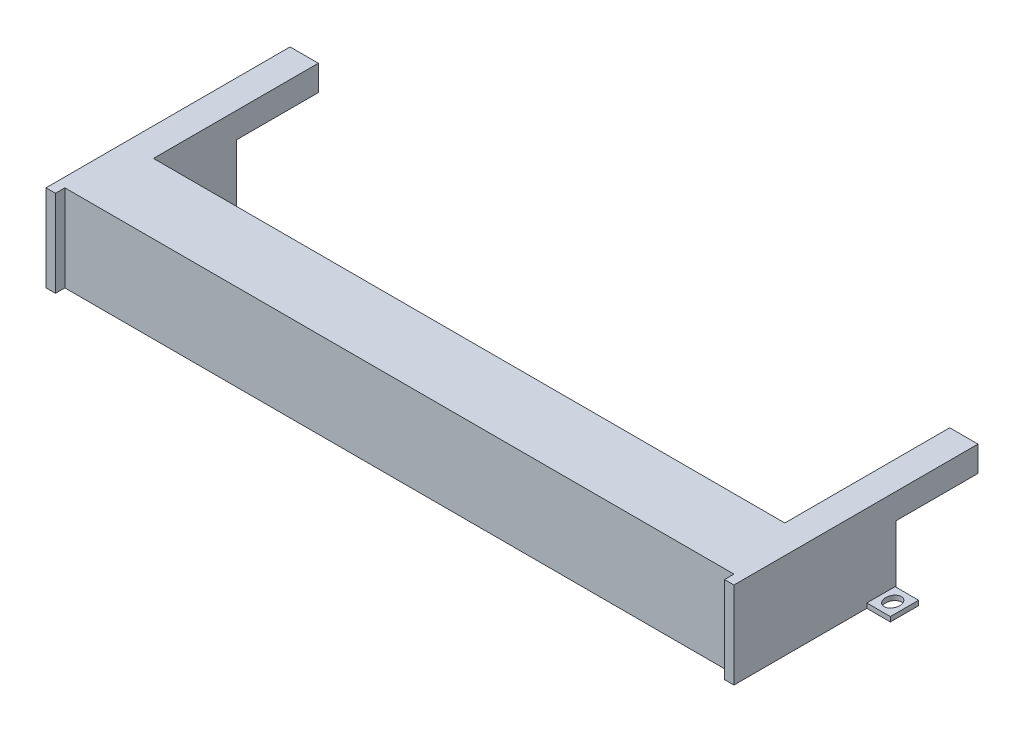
ISO-10303-21;
HEADER;
FILE_DESCRIPTION(('STEP AP214'),'2;1');
FILE_NAME('part.step','',(''),(''),'','','');
FILE_SCHEMA(('AUTOMOTIVE_DESIGN { 1 0 10303 214 1 1 1 1 }'));
ENDSEC;
DATA;
#1=APPLICATION_CONTEXT('core data for automotive mechanical design processes');
#2=APPLICATION_PROTOCOL_DEFINITION('international standard','automotive_design',2000,#1);
#3=PRODUCT_CONTEXT('',#1,'mechanical');
#4=PRODUCT('Part','Part','',(#3));
#5=PRODUCT_RELATED_PRODUCT_CATEGORY('part','',(#4));
#6=PRODUCT_DEFINITION_FORMATION('','',#4);
#7=PRODUCT_DEFINITION_CONTEXT('part definition',#1,'design');
#8=PRODUCT_DEFINITION('design','',#6,#7);
#9=PRODUCT_DEFINITION_SHAPE('','',#8);
#10=(LENGTH_UNIT() NAMED_UNIT(*) SI_UNIT(.MILLI.,.METRE.));
#11=(NAMED_UNIT(*) PLANE_ANGLE_UNIT() SI_UNIT($,.RADIAN.));
#12=(NAMED_UNIT(*) SI_UNIT($,.STERADIAN.) SOLID_ANGLE_UNIT());
#13=UNCERTAINTY_MEASURE_WITH_UNIT(LENGTH_MEASURE(1.E-05),#10,'distance_accuracy_value','');
#14=(GEOMETRIC_REPRESENTATION_CONTEXT(3) GLOBAL_UNCERTAINTY_ASSIGNED_CONTEXT((#13)) GLOBAL_UNIT_ASSIGNED_CONTEXT((#10,
#11,#12)) REPRESENTATION_CONTEXT('',''));
#15=CARTESIAN_POINT('',(0.,0.,0.));
#16=DIRECTION('',(0.,0.,1.));
#17=DIRECTION('',(1.,0.,0.));
#18=AXIS2_PLACEMENT_3D('',#15,#16,#17);
#19=CARTESIAN_POINT('',(-36.5,9.2,-12.95));
#20=DIRECTION('',(1.,0.,0.));
#21=DIRECTION('',(0.,0.,-1.));
#22=AXIS2_PLACEMENT_3D('',#19,#20,#21);
#23=PLANE('',#22);
#24=DIRECTION('',(0.,-1.,0.));
#25=VECTOR('',#24,1.);
#26=CARTESIAN_POINT('',(-36.5,0.5,-4.14999999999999));
#27=LINE('',#26,#25);
#28=CARTESIAN_POINT('',(-36.5,0.5,-4.14999999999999));
#29=VERTEX_POINT('',#28);
#30=CARTESIAN_POINT('',(-36.5,0.,-4.14999999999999));
#31=VERTEX_POINT('',#30);
#32=EDGE_CURVE('E215',#29,#31,#27,.T.);
#33=ORIENTED_EDGE('',*,*,#32,.F.);
#34=DIRECTION('',(0.,0.,-1.));
#35=VECTOR('',#34,1.);
#36=CARTESIAN_POINT('',(-36.5,0.5,-1.14999999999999));
#37=LINE('',#36,#35);
#38=CARTESIAN_POINT('',(-36.5,0.5,-1.14999999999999));
#39=VERTEX_POINT('',#38);
#40=EDGE_CURVE('E200',#39,#29,#37,.T.);
#41=ORIENTED_EDGE('',*,*,#40,.F.);
#42=DIRECTION('',(0.,-1.,0.));
#43=VECTOR('',#42,1.);
#44=CARTESIAN_POINT('',(-36.5,0.5,-1.14999999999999));
#45=LINE('',#44,#43);
#46=CARTESIAN_POINT('',(-36.5,0.,-1.15));
#47=VERTEX_POINT('',#46);
#48=EDGE_CURVE('E206',#39,#47,#45,.T.);
#49=ORIENTED_EDGE('',*,*,#48,.T.);
#50=DIRECTION('',(0.,0.,1.));
#51=VECTOR('',#50,1.);
#52=CARTESIAN_POINT('',(-36.5,0.,-12.95));
#53=LINE('',#52,#51);
#54=CARTESIAN_POINT('',(-36.5,0.,12.95));
#55=VERTEX_POINT('',#54);
#56=EDGE_CURVE('E237',#47,#55,#53,.T.);
#57=ORIENTED_EDGE('',*,*,#56,.T.);
#58=DIRECTION('',(0.,-1.,0.));
#59=VECTOR('',#58,1.);
#60=CARTESIAN_POINT('',(-36.5,9.2,12.95));
#61=LINE('',#60,#59);
#62=CARTESIAN_POINT('',(-36.5,9.2,12.95));
#63=VERTEX_POINT('',#62);
#64=EDGE_CURVE('E404',#63,#55,#61,.T.);
#65=ORIENTED_EDGE('',*,*,#64,.F.);
#66=DIRECTION('',(0.,0.,1.));
#67=VECTOR('',#66,1.);
#68=CARTESIAN_POINT('',(-36.5,9.2,-12.95));
#69=LINE('',#68,#67);
#70=CARTESIAN_POINT('',(-36.5,9.2,-12.95));
#71=VERTEX_POINT('',#70);
#72=EDGE_CURVE('E376',#71,#63,#69,.T.);
#73=ORIENTED_EDGE('',*,*,#72,.F.);
#74=DIRECTION('',(0.,-1.,0.));
#75=VECTOR('',#74,1.);
#76=CARTESIAN_POINT('',(-36.5,9.2,-12.95));
#77=LINE('',#76,#75);
#78=CARTESIAN_POINT('',(-36.5,6.5,-12.95));
#79=VERTEX_POINT('',#78);
#80=EDGE_CURVE('E370',#71,#79,#77,.T.);
#81=ORIENTED_EDGE('',*,*,#80,.T.);
#82=DIRECTION('',(0.,0.,-1.));
#83=VECTOR('',#82,1.);
#84=CARTESIAN_POINT('',(-36.5,6.5,-12.95));
#85=LINE('',#84,#83);
#86=CARTESIAN_POINT('',(-36.5,6.5,-4.25));
#87=VERTEX_POINT('',#86);
#88=EDGE_CURVE('E481',#87,#79,#85,.T.);
#89=ORIENTED_EDGE('',*,*,#88,.F.);
#90=DIRECTION('',(0.,1.,0.));
#91=VECTOR('',#90,1.);
#92=CARTESIAN_POINT('',(-36.5,0.,-4.25));
#93=LINE('',#92,#91);
#94=CARTESIAN_POINT('',(-36.5,0.,-4.25));
#95=VERTEX_POINT('',#94);
#96=EDGE_CURVE('E468',#95,#87,#93,.T.);
#97=ORIENTED_EDGE('',*,*,#96,.F.);
#98=EDGE_CURVE('E412',#95,#31,#53,.T.);
#99=ORIENTED_EDGE('',*,*,#98,.T.);
#100=EDGE_LOOP('',(#33,#41,#49,#57,#65,#73,#81,#89,#97,#99));
#101=FACE_BOUND('',#100,.T.);
#102=ADVANCED_FACE('F31',(#101),#23,.F.);
#103=CARTESIAN_POINT('',(-36.5,9.2,-12.95));
#104=DIRECTION('',(0.,0.,1.));
#105=DIRECTION('',(1.,0.,0.));
#106=AXIS2_PLACEMENT_3D('',#103,#104,#105);
#107=PLANE('',#106);
#108=DIRECTION('',(-1.,0.,0.));
#109=VECTOR('',#108,1.);
#110=CARTESIAN_POINT('',(-36.5,9.2,-12.95));
#111=LINE('',#110,#109);
#112=CARTESIAN_POINT('',(-33.5,9.2,-12.95));
#113=VERTEX_POINT('',#112);
#114=EDGE_CURVE('E366',#113,#71,#111,.T.);
#115=ORIENTED_EDGE('',*,*,#114,.F.);
#116=DIRECTION('',(0.,1.,0.));
#117=VECTOR('',#116,1.);
#118=CARTESIAN_POINT('',(-33.5,-4.99999999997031E-05,-12.95));
#119=LINE('',#118,#117);
#120=CARTESIAN_POINT('',(-33.5,6.5,-12.95));
#121=VERTEX_POINT('',#120);
#122=EDGE_CURVE('E260',#121,#113,#119,.T.);
#123=ORIENTED_EDGE('',*,*,#122,.F.);
#124=DIRECTION('',(1.,0.,0.));
#125=VECTOR('',#124,1.);
#126=CARTESIAN_POINT('',(-36.501,6.5,-12.95));
#127=LINE('',#126,#125);
#128=EDGE_CURVE('E487',#79,#121,#127,.T.);
#129=ORIENTED_EDGE('',*,*,#128,.F.);
#130=ORIENTED_EDGE('',*,*,#80,.F.);
#131=EDGE_LOOP('',(#115,#123,#129,#130));
#132=FACE_BOUND('',#131,.T.);
#133=ADVANCED_FACE('F347',(#132),#107,.F.);
#134=CARTESIAN_POINT('',(-36.501,0.,-4.25));
#135=DIRECTION('',(0.,0.,1.));
#136=DIRECTION('',(1.,0.,0.));
#137=AXIS2_PLACEMENT_3D('',#134,#135,#136);
#138=PLANE('',#137);
#139=DIRECTION('',(1.,0.,0.));
#140=VECTOR('',#139,1.);
#141=CARTESIAN_POINT('',(-36.501,6.5,-4.25));
#142=LINE('',#141,#140);
#143=CARTESIAN_POINT('',(-33.5,6.5,-4.25));
#144=VERTEX_POINT('',#143);
#145=EDGE_CURVE('E483',#87,#144,#142,.T.);
#146=ORIENTED_EDGE('',*,*,#145,.T.);
#147=DIRECTION('',(0.,-1.,0.));
#148=VECTOR('',#147,1.);
#149=CARTESIAN_POINT('',(-33.5,0.,-4.25));
#150=LINE('',#149,#148);
#151=CARTESIAN_POINT('',(-33.5,0.,-4.25));
#152=VERTEX_POINT('',#151);
#153=EDGE_CURVE('E272',#144,#152,#150,.T.);
#154=ORIENTED_EDGE('',*,*,#153,.T.);
#155=DIRECTION('',(1.,0.,0.));
#156=VECTOR('',#155,1.);
#157=CARTESIAN_POINT('',(-36.501,0.,-4.25));
#158=LINE('',#157,#156);
#159=EDGE_CURVE('E478',#95,#152,#158,.T.);
#160=ORIENTED_EDGE('',*,*,#159,.F.);
#161=ORIENTED_EDGE('',*,*,#96,.T.);
#162=EDGE_LOOP('',(#146,#154,#160,#161));
#163=FACE_BOUND('',#162,.T.);
#164=ADVANCED_FACE('F328',(#163),#138,.F.);
#165=CARTESIAN_POINT('',(-36.501,6.5,-12.95));
#166=DIRECTION('',(0.,1.,0.));
#167=DIRECTION('',(0.,0.,1.));
#168=AXIS2_PLACEMENT_3D('',#165,#166,#167);
#169=PLANE('',#168);
#170=ORIENTED_EDGE('',*,*,#128,.T.);
#171=DIRECTION('',(0.,0.,1.));
#172=VECTOR('',#171,1.);
#173=CARTESIAN_POINT('',(-33.5,6.5,-12.95));
#174=LINE('',#173,#172);
#175=EDGE_CURVE('E40',#121,#144,#174,.T.);
#176=ORIENTED_EDGE('',*,*,#175,.T.);
#177=ORIENTED_EDGE('',*,*,#145,.F.);
#178=ORIENTED_EDGE('',*,*,#88,.T.);
#179=EDGE_LOOP('',(#170,#176,#177,#178));
#180=FACE_BOUND('',#179,.T.);
#181=ADVANCED_FACE('F332',(#180),#169,.F.);
#182=CARTESIAN_POINT('',(36.5,9.2,-12.95));
#183=DIRECTION('',(-1.,0.,0.));
#184=DIRECTION('',(0.,0.,1.));
#185=AXIS2_PLACEMENT_3D('',#182,#183,#184);
#186=PLANE('',#185);
#187=DIRECTION('',(0.,-1.,0.));
#188=VECTOR('',#187,1.);
#189=CARTESIAN_POINT('',(36.5,0.5,-1.14999999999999));
#190=LINE('',#189,#188);
#191=CARTESIAN_POINT('',(36.5,0.5,-1.14999999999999));
#192=VERTEX_POINT('',#191);
#193=CARTESIAN_POINT('',(36.5,0.,-1.14999999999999));
#194=VERTEX_POINT('',#193);
#195=EDGE_CURVE('E431',#192,#194,#190,.T.);
#196=ORIENTED_EDGE('',*,*,#195,.F.);
#197=DIRECTION('',(0.,0.,-1.));
#198=VECTOR('',#197,1.);
#199=CARTESIAN_POINT('',(36.5,0.5,-1.14999999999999));
#200=LINE('',#199,#198);
#201=CARTESIAN_POINT('',(36.5,0.5,-4.14999999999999));
#202=VERTEX_POINT('',#201);
#203=EDGE_CURVE('E427',#192,#202,#200,.T.);
#204=ORIENTED_EDGE('',*,*,#203,.T.);
#205=DIRECTION('',(0.,-1.,0.));
#206=VECTOR('',#205,1.);
#207=CARTESIAN_POINT('',(36.5,0.5,-4.14999999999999));
#208=LINE('',#207,#206);
#209=CARTESIAN_POINT('',(36.5,0.,-4.15));
#210=VERTEX_POINT('',#209);
#211=EDGE_CURVE('E435',#202,#210,#208,.T.);
#212=ORIENTED_EDGE('',*,*,#211,.T.);
#213=DIRECTION('',(0.,0.,-1.));
#214=VECTOR('',#213,1.);
#215=CARTESIAN_POINT('',(36.5,0.,-12.95));
#216=LINE('',#215,#214);
#217=CARTESIAN_POINT('',(36.5,0.,-4.25));
#218=VERTEX_POINT('',#217);
#219=EDGE_CURVE('E393',#210,#218,#216,.T.);
#220=ORIENTED_EDGE('',*,*,#219,.T.);
#221=DIRECTION('',(0.,-1.,0.));
#222=VECTOR('',#221,1.);
#223=CARTESIAN_POINT('',(36.5,0.,-4.25));
#224=LINE('',#223,#222);
#225=CARTESIAN_POINT('',(36.5,6.5,-4.25));
#226=VERTEX_POINT('',#225);
#227=EDGE_CURVE('E474',#226,#218,#224,.T.);
#228=ORIENTED_EDGE('',*,*,#227,.F.);
#229=DIRECTION('',(0.,0.,1.));
#230=VECTOR('',#229,1.);
#231=CARTESIAN_POINT('',(36.5,6.5,-12.95));
#232=LINE('',#231,#230);
#233=CARTESIAN_POINT('',(36.5,6.5,-12.95));
#234=VERTEX_POINT('',#233);
#235=EDGE_CURVE('E471',#234,#226,#232,.T.);
#236=ORIENTED_EDGE('',*,*,#235,.F.);
#237=DIRECTION('',(0.,-1.,0.));
#238=VECTOR('',#237,1.);
#239=CARTESIAN_POINT('',(36.5,9.2,-12.95));
#240=LINE('',#239,#238);
#241=CARTESIAN_POINT('',(36.5,9.2,-12.95));
#242=VERTEX_POINT('',#241);
#243=EDGE_CURVE('E399',#242,#234,#240,.T.);
#244=ORIENTED_EDGE('',*,*,#243,.F.);
#245=DIRECTION('',(0.,0.,-1.));
#246=VECTOR('',#245,1.);
#247=CARTESIAN_POINT('',(36.5,9.2,-12.95));
#248=LINE('',#247,#246);
#249=CARTESIAN_POINT('',(36.5,9.2,12.95));
#250=VERTEX_POINT('',#249);
#251=EDGE_CURVE('E373',#250,#242,#248,.T.);
#252=ORIENTED_EDGE('',*,*,#251,.F.);
#253=DIRECTION('',(0.,-1.,0.));
#254=VECTOR('',#253,1.);
#255=CARTESIAN_POINT('',(36.5,9.2,12.95));
#256=LINE('',#255,#254);
#257=CARTESIAN_POINT('',(36.5,0.,12.95));
#258=VERTEX_POINT('',#257);
#259=EDGE_CURVE('E387',#250,#258,#256,.T.);
#260=ORIENTED_EDGE('',*,*,#259,.T.);
#261=EDGE_CURVE('E396',#258,#194,#216,.T.);
#262=ORIENTED_EDGE('',*,*,#261,.T.);
#263=EDGE_LOOP('',(#196,#204,#212,#220,#228,#236,#244,#252,#260,#262));
#264=FACE_BOUND('',#263,.T.);
#265=ADVANCED_FACE('F33',(#264),#186,.F.);
#266=CARTESIAN_POINT('',(-36.5,9.2,12.95));
#267=DIRECTION('',(0.,0.,-1.));
#268=DIRECTION('',(-1.,0.,0.));
#269=AXIS2_PLACEMENT_3D('',#266,#267,#268);
#270=PLANE('',#269);
#271=DIRECTION('',(1.,0.,0.));
#272=VECTOR('',#271,1.);
#273=CARTESIAN_POINT('',(-36.5,0.,12.95));
#274=LINE('',#273,#272);
#275=CARTESIAN_POINT('',(-35.5,0.,12.95));
#276=VERTEX_POINT('',#275);
#277=EDGE_CURVE('E378',#55,#276,#274,.T.);
#278=ORIENTED_EDGE('',*,*,#277,.T.);
#279=DIRECTION('',(0.,-1.,0.));
#280=VECTOR('',#279,1.);
#281=CARTESIAN_POINT('',(-35.5,-0.001000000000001,12.95));
#282=LINE('',#281,#280);
#283=CARTESIAN_POINT('',(-35.5,9.2,12.95));
#284=VERTEX_POINT('',#283);
#285=EDGE_CURVE('E447',#284,#276,#282,.T.);
#286=ORIENTED_EDGE('',*,*,#285,.F.);
#287=DIRECTION('',(1.,0.,0.));
#288=VECTOR('',#287,1.);
#289=CARTESIAN_POINT('',(-36.5,9.2,12.95));
#290=LINE('',#289,#288);
#291=EDGE_CURVE('E384',#63,#284,#290,.T.);
#292=ORIENTED_EDGE('',*,*,#291,.F.);
#293=ORIENTED_EDGE('',*,*,#64,.T.);
#294=EDGE_LOOP('',(#278,#286,#292,#293));
#295=FACE_BOUND('',#294,.T.);
#296=ADVANCED_FACE('F345',(#295),#270,.F.);
#297=CARTESIAN_POINT('',(33.5,6.5,-12.95));
#298=VERTEX_POINT('',#297);
#299=EDGE_CURVE('E477',#298,#234,#127,.T.);
#300=ORIENTED_EDGE('',*,*,#299,.F.);
#301=DIRECTION('',(0.,1.,0.));
#302=VECTOR('',#301,1.);
#303=CARTESIAN_POINT('',(33.5,-4.99999999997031E-05,-12.95));
#304=LINE('',#303,#302);
#305=CARTESIAN_POINT('',(33.5,9.2,-12.95));
#306=VERTEX_POINT('',#305);
#307=EDGE_CURVE('E56',#298,#306,#304,.T.);
#308=ORIENTED_EDGE('',*,*,#307,.T.);
#309=EDGE_CURVE('E372',#242,#306,#111,.T.);
#310=ORIENTED_EDGE('',*,*,#309,.F.);
#311=ORIENTED_EDGE('',*,*,#243,.T.);
#312=EDGE_LOOP('',(#300,#308,#310,#311));
#313=FACE_BOUND('',#312,.T.);
#314=ADVANCED_FACE('F343',(#313),#107,.F.);
#315=CARTESIAN_POINT('',(35.5,9.2,12.95));
#316=VERTEX_POINT('',#315);
#317=EDGE_CURVE('E383',#316,#250,#290,.T.);
#318=ORIENTED_EDGE('',*,*,#317,.F.);
#319=DIRECTION('',(0.,1.,0.));
#320=VECTOR('',#319,1.);
#321=CARTESIAN_POINT('',(35.5,-0.001000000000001,12.95));
#322=LINE('',#321,#320);
#323=CARTESIAN_POINT('',(35.5,0.,12.95));
#324=VERTEX_POINT('',#323);
#325=EDGE_CURVE('E433',#324,#316,#322,.T.);
#326=ORIENTED_EDGE('',*,*,#325,.F.);
#327=EDGE_CURVE('E409',#324,#258,#274,.T.);
#328=ORIENTED_EDGE('',*,*,#327,.T.);
#329=ORIENTED_EDGE('',*,*,#259,.F.);
#330=EDGE_LOOP('',(#318,#326,#328,#329));
#331=FACE_BOUND('',#330,.T.);
#332=ADVANCED_FACE('F336',(#331),#270,.F.);
#333=CARTESIAN_POINT('',(36.5,9.2,12.95));
#334=DIRECTION('',(0.,1.,0.));
#335=DIRECTION('',(0.,0.,1.));
#336=AXIS2_PLACEMENT_3D('',#333,#334,#335);
#337=PLANE('',#336);
#338=DIRECTION('',(0.,0.,1.));
#339=VECTOR('',#338,1.);
#340=CARTESIAN_POINT('',(-33.5,9.2,-12.95));
#341=LINE('',#340,#339);
#342=CARTESIAN_POINT('',(-33.5,9.2,4.55));
#343=VERTEX_POINT('',#342);
#344=EDGE_CURVE('E233',#113,#343,#341,.T.);
#345=ORIENTED_EDGE('',*,*,#344,.F.);
#346=ORIENTED_EDGE('',*,*,#114,.T.);
#347=ORIENTED_EDGE('',*,*,#72,.T.);
#348=ORIENTED_EDGE('',*,*,#291,.T.);
#349=DIRECTION('',(0.,0.,1.));
#350=VECTOR('',#349,1.);
#351=CARTESIAN_POINT('',(-35.5,9.2,16.9167711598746));
#352=LINE('',#351,#350);
#353=CARTESIAN_POINT('',(-35.5,9.2,11.95));
#354=VERTEX_POINT('',#353);
#355=EDGE_CURVE('E454',#354,#284,#352,.T.);
#356=ORIENTED_EDGE('',*,*,#355,.F.);
#357=DIRECTION('',(-1.,0.,0.));
#358=VECTOR('',#357,1.);
#359=CARTESIAN_POINT('',(-35.5,9.2,11.95));
#360=LINE('',#359,#358);
#361=CARTESIAN_POINT('',(35.5,9.2,11.95));
#362=VERTEX_POINT('',#361);
#363=EDGE_CURVE('E459',#362,#354,#360,.T.);
#364=ORIENTED_EDGE('',*,*,#363,.F.);
#365=DIRECTION('',(0.,0.,-1.));
#366=VECTOR('',#365,1.);
#367=CARTESIAN_POINT('',(35.5,9.2,16.9167711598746));
#368=LINE('',#367,#366);
#369=EDGE_CURVE('E456',#316,#362,#368,.T.);
#370=ORIENTED_EDGE('',*,*,#369,.F.);
#371=ORIENTED_EDGE('',*,*,#317,.T.);
#372=ORIENTED_EDGE('',*,*,#251,.T.);
#373=ORIENTED_EDGE('',*,*,#309,.T.);
#374=DIRECTION('',(0.,0.,-1.));
#375=VECTOR('',#374,1.);
#376=CARTESIAN_POINT('',(33.5,9.2,-12.95));
#377=LINE('',#376,#375);
#378=CARTESIAN_POINT('',(33.5,9.2,4.55));
#379=VERTEX_POINT('',#378);
#380=EDGE_CURVE('E253',#379,#306,#377,.T.);
#381=ORIENTED_EDGE('',*,*,#380,.F.);
#382=DIRECTION('',(1.,0.,0.));
#383=VECTOR('',#382,1.);
#384=CARTESIAN_POINT('',(-33.5,9.2,4.55));
#385=LINE('',#384,#383);
#386=EDGE_CURVE('E247',#343,#379,#385,.T.);
#387=ORIENTED_EDGE('',*,*,#386,.F.);
#388=EDGE_LOOP('',(#345,#346,#347,#348,#356,#364,#370,#371,#372,#373,#381,#387));
#389=FACE_BOUND('',#388,.T.);
#390=ADVANCED_FACE('F333',(#389),#337,.T.);
#391=CARTESIAN_POINT('',(36.5,0.,12.95));
#392=DIRECTION('',(0.,1.,0.));
#393=DIRECTION('',(0.,0.,1.));
#394=AXIS2_PLACEMENT_3D('',#391,#392,#393);
#395=PLANE('',#394);
#396=ORIENTED_EDGE('',*,*,#159,.T.);
#397=DIRECTION('',(0.,0.,1.));
#398=VECTOR('',#397,1.);
#399=CARTESIAN_POINT('',(-33.5,0.,12.95));
#400=LINE('',#399,#398);
#401=CARTESIAN_POINT('',(-33.5,0.,4.55));
#402=VERTEX_POINT('',#401);
#403=EDGE_CURVE('E275',#152,#402,#400,.T.);
#404=ORIENTED_EDGE('',*,*,#403,.T.);
#405=DIRECTION('',(1.,0.,0.));
#406=VECTOR('',#405,1.);
#407=CARTESIAN_POINT('',(36.5,0.,4.55));
#408=LINE('',#407,#406);
#409=CARTESIAN_POINT('',(33.5,0.,4.55));
#410=VERTEX_POINT('',#409);
#411=EDGE_CURVE('E11',#402,#410,#408,.T.);
#412=ORIENTED_EDGE('',*,*,#411,.T.);
#413=DIRECTION('',(0.,0.,-1.));
#414=VECTOR('',#413,1.);
#415=CARTESIAN_POINT('',(33.5,0.,12.95));
#416=LINE('',#415,#414);
#417=CARTESIAN_POINT('',(33.5,0.,-4.25));
#418=VERTEX_POINT('',#417);
#419=EDGE_CURVE('E269',#410,#418,#416,.T.);
#420=ORIENTED_EDGE('',*,*,#419,.T.);
#421=EDGE_CURVE('E482',#418,#218,#158,.T.);
#422=ORIENTED_EDGE('',*,*,#421,.T.);
#423=ORIENTED_EDGE('',*,*,#219,.F.);
#424=DIRECTION('',(1.,0.,0.));
#425=VECTOR('',#424,1.);
#426=CARTESIAN_POINT('',(39.,0.,-4.14999999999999));
#427=LINE('',#426,#425);
#428=CARTESIAN_POINT('',(39.,0.,-4.14999999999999));
#429=VERTEX_POINT('',#428);
#430=EDGE_CURVE('E283',#210,#429,#427,.T.);
#431=ORIENTED_EDGE('',*,*,#430,.T.);
#432=DIRECTION('',(0.,0.,1.));
#433=VECTOR('',#432,1.);
#434=CARTESIAN_POINT('',(39.,0.,-1.14999999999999));
#435=LINE('',#434,#433);
#436=CARTESIAN_POINT('',(39.,0.,-1.14999999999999));
#437=VERTEX_POINT('',#436);
#438=EDGE_CURVE('E428',#429,#437,#435,.T.);
#439=ORIENTED_EDGE('',*,*,#438,.T.);
#440=DIRECTION('',(-1.,0.,0.));
#441=VECTOR('',#440,1.);
#442=CARTESIAN_POINT('',(39.,0.,-1.14999999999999));
#443=LINE('',#442,#441);
#444=EDGE_CURVE('E424',#437,#194,#443,.T.);
#445=ORIENTED_EDGE('',*,*,#444,.T.);
#446=ORIENTED_EDGE('',*,*,#261,.F.);
#447=ORIENTED_EDGE('',*,*,#327,.F.);
#448=DIRECTION('',(0.,0.,1.));
#449=VECTOR('',#448,1.);
#450=CARTESIAN_POINT('',(35.5,0.,16.9167711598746));
#451=LINE('',#450,#449);
#452=CARTESIAN_POINT('',(35.5,0.,11.95));
#453=VERTEX_POINT('',#452);
#454=EDGE_CURVE('E465',#453,#324,#451,.T.);
#455=ORIENTED_EDGE('',*,*,#454,.F.);
#456=DIRECTION('',(1.,0.,0.));
#457=VECTOR('',#456,1.);
#458=CARTESIAN_POINT('',(-35.5,0.,11.95));
#459=LINE('',#458,#457);
#460=CARTESIAN_POINT('',(-35.5,0.,11.95));
#461=VERTEX_POINT('',#460);
#462=EDGE_CURVE('E449',#461,#453,#459,.T.);
#463=ORIENTED_EDGE('',*,*,#462,.F.);
#464=DIRECTION('',(0.,0.,-1.));
#465=VECTOR('',#464,1.);
#466=CARTESIAN_POINT('',(-35.5,0.,16.9167711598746));
#467=LINE('',#466,#465);
#468=EDGE_CURVE('E452',#276,#461,#467,.T.);
#469=ORIENTED_EDGE('',*,*,#468,.F.);
#470=ORIENTED_EDGE('',*,*,#277,.F.);
#471=ORIENTED_EDGE('',*,*,#56,.F.);
#472=DIRECTION('',(1.,0.,0.));
#473=VECTOR('',#472,1.);
#474=CARTESIAN_POINT('',(-39.,0.,-1.14999999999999));
#475=LINE('',#474,#473);
#476=CARTESIAN_POINT('',(-39.,0.,-1.14999999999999));
#477=VERTEX_POINT('',#476);
#478=EDGE_CURVE('E48',#477,#47,#475,.T.);
#479=ORIENTED_EDGE('',*,*,#478,.F.);
#480=DIRECTION('',(0.,0.,1.));
#481=VECTOR('',#480,1.);
#482=CARTESIAN_POINT('',(-39.,0.,-1.14999999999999));
#483=LINE('',#482,#481);
#484=CARTESIAN_POINT('',(-39.,0.,-4.14999999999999));
#485=VERTEX_POINT('',#484);
#486=EDGE_CURVE('E218',#485,#477,#483,.T.);
#487=ORIENTED_EDGE('',*,*,#486,.F.);
#488=DIRECTION('',(-1.,0.,0.));
#489=VECTOR('',#488,1.);
#490=CARTESIAN_POINT('',(-39.,0.,-4.14999999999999));
#491=LINE('',#490,#489);
#492=EDGE_CURVE('E216',#31,#485,#491,.T.);
#493=ORIENTED_EDGE('',*,*,#492,.F.);
#494=ORIENTED_EDGE('',*,*,#98,.F.);
#495=EDGE_LOOP('',(#396,#404,#412,#420,#422,#423,#431,#439,#445,#446,#447,#455,#463,#469,#470,
#471,#479,#487,#493,#494));
#496=FACE_BOUND('',#495,.T.);
#497=CARTESIAN_POINT('',(37.75,0.,-2.64999999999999));
#498=DIRECTION('',(0.,-1.,0.));
#499=DIRECTION('',(0.,0.,-1.));
#500=AXIS2_PLACEMENT_3D('',#497,#498,#499);
#501=ELLIPSE('',#500,0.924731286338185,0.742484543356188);
#502=CARTESIAN_POINT('',(37.75,0.,-3.57473128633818));
#503=VERTEX_POINT('',#502);
#504=EDGE_CURVE('E278',#503,#503,#501,.T.);
#505=ORIENTED_EDGE('',*,*,#504,.F.);
#506=EDGE_LOOP('',(#505));
#507=FACE_BOUND('',#506,.T.);
#508=CARTESIAN_POINT('',(-37.75,0.,-2.64999999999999));
#509=DIRECTION('',(0.,1.,0.));
#510=DIRECTION('',(0.,0.,-1.));
#511=AXIS2_PLACEMENT_3D('',#508,#509,#510);
#512=ELLIPSE('',#511,0.924731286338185,0.742484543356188);
#513=CARTESIAN_POINT('',(-37.75,0.,-3.57473128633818));
#514=VERTEX_POINT('',#513);
#515=EDGE_CURVE('E221',#514,#514,#512,.T.);
#516=ORIENTED_EDGE('',*,*,#515,.T.);
#517=EDGE_LOOP('',(#516));
#518=FACE_BOUND('',#517,.T.);
#519=ADVANCED_FACE('F326',(#496,#507,#518),#395,.F.);
#520=ORIENTED_EDGE('',*,*,#421,.F.);
#521=DIRECTION('',(0.,1.,0.));
#522=VECTOR('',#521,1.);
#523=CARTESIAN_POINT('',(33.5,0.,-4.25));
#524=LINE('',#523,#522);
#525=CARTESIAN_POINT('',(33.5,6.5,-4.25));
#526=VERTEX_POINT('',#525);
#527=EDGE_CURVE('E262',#418,#526,#524,.T.);
#528=ORIENTED_EDGE('',*,*,#527,.T.);
#529=EDGE_CURVE('E486',#526,#226,#142,.T.);
#530=ORIENTED_EDGE('',*,*,#529,.T.);
#531=ORIENTED_EDGE('',*,*,#227,.T.);
#532=EDGE_LOOP('',(#520,#528,#530,#531));
#533=FACE_BOUND('',#532,.T.);
#534=ADVANCED_FACE('F323',(#533),#138,.F.);
#535=ORIENTED_EDGE('',*,*,#529,.F.);
#536=DIRECTION('',(0.,0.,-1.));
#537=VECTOR('',#536,1.);
#538=CARTESIAN_POINT('',(33.5,6.5,-12.95));
#539=LINE('',#538,#537);
#540=EDGE_CURVE('E402',#526,#298,#539,.T.);
#541=ORIENTED_EDGE('',*,*,#540,.T.);
#542=ORIENTED_EDGE('',*,*,#299,.T.);
#543=ORIENTED_EDGE('',*,*,#235,.T.);
#544=EDGE_LOOP('',(#535,#541,#542,#543));
#545=FACE_BOUND('',#544,.T.);
#546=ADVANCED_FACE('F321',(#545),#169,.F.);
#547=CARTESIAN_POINT('',(-35.5,-0.001000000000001,16.9167711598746));
#548=DIRECTION('',(-1.,0.,0.));
#549=DIRECTION('',(0.,0.,1.));
#550=AXIS2_PLACEMENT_3D('',#547,#548,#549);
#551=PLANE('',#550);
#552=ORIENTED_EDGE('',*,*,#285,.T.);
#553=ORIENTED_EDGE('',*,*,#468,.T.);
#554=DIRECTION('',(0.,1.,0.));
#555=VECTOR('',#554,1.);
#556=CARTESIAN_POINT('',(-35.5,-0.001000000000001,11.95));
#557=LINE('',#556,#555);
#558=EDGE_CURVE('E463',#461,#354,#557,.T.);
#559=ORIENTED_EDGE('',*,*,#558,.T.);
#560=ORIENTED_EDGE('',*,*,#355,.T.);
#561=EDGE_LOOP('',(#552,#553,#559,#560));
#562=FACE_BOUND('',#561,.T.);
#563=ADVANCED_FACE('F314',(#562),#551,.F.);
#564=CARTESIAN_POINT('',(-35.5,-0.001000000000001,11.95));
#565=DIRECTION('',(0.,0.,-1.));
#566=DIRECTION('',(-1.,0.,0.));
#567=AXIS2_PLACEMENT_3D('',#564,#565,#566);
#568=PLANE('',#567);
#569=ORIENTED_EDGE('',*,*,#462,.T.);
#570=DIRECTION('',(0.,1.,0.));
#571=VECTOR('',#570,1.);
#572=CARTESIAN_POINT('',(35.5,-0.001000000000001,11.95));
#573=LINE('',#572,#571);
#574=EDGE_CURVE('E462',#453,#362,#573,.T.);
#575=ORIENTED_EDGE('',*,*,#574,.T.);
#576=ORIENTED_EDGE('',*,*,#363,.T.);
#577=ORIENTED_EDGE('',*,*,#558,.F.);
#578=EDGE_LOOP('',(#569,#575,#576,#577));
#579=FACE_BOUND('',#578,.T.);
#580=ADVANCED_FACE('F311',(#579),#568,.F.);
#581=CARTESIAN_POINT('',(35.5,-0.001000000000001,16.9167711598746));
#582=DIRECTION('',(1.,0.,0.));
#583=DIRECTION('',(0.,0.,-1.));
#584=AXIS2_PLACEMENT_3D('',#581,#582,#583);
#585=PLANE('',#584);
#586=ORIENTED_EDGE('',*,*,#325,.T.);
#587=ORIENTED_EDGE('',*,*,#369,.T.);
#588=ORIENTED_EDGE('',*,*,#574,.F.);
#589=ORIENTED_EDGE('',*,*,#454,.T.);
#590=EDGE_LOOP('',(#586,#587,#588,#589));
#591=FACE_BOUND('',#590,.T.);
#592=ADVANCED_FACE('F303',(#591),#585,.F.);
#593=CARTESIAN_POINT('',(39.,0.5,-1.14999999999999));
#594=DIRECTION('',(0.,0.,1.));
#595=DIRECTION('',(1.,0.,0.));
#596=AXIS2_PLACEMENT_3D('',#593,#594,#595);
#597=PLANE('',#596);
#598=ORIENTED_EDGE('',*,*,#444,.F.);
#599=DIRECTION('',(0.,-1.,0.));
#600=VECTOR('',#599,1.);
#601=CARTESIAN_POINT('',(39.,0.5,-1.14999999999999));
#602=LINE('',#601,#600);
#603=CARTESIAN_POINT('',(39.,0.5,-1.14999999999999));
#604=VERTEX_POINT('',#603);
#605=EDGE_CURVE('E434',#604,#437,#602,.T.);
#606=ORIENTED_EDGE('',*,*,#605,.F.);
#607=DIRECTION('',(-1.,0.,0.));
#608=VECTOR('',#607,1.);
#609=CARTESIAN_POINT('',(39.,0.5,-1.14999999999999));
#610=LINE('',#609,#608);
#611=EDGE_CURVE('E440',#604,#192,#610,.T.);
#612=ORIENTED_EDGE('',*,*,#611,.T.);
#613=ORIENTED_EDGE('',*,*,#195,.T.);
#614=EDGE_LOOP('',(#598,#606,#612,#613));
#615=FACE_BOUND('',#614,.T.);
#616=ADVANCED_FACE('F299',(#615),#597,.T.);
#617=CARTESIAN_POINT('',(39.,0.5,-1.14999999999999));
#618=DIRECTION('',(1.,0.,0.));
#619=DIRECTION('',(0.,0.,-1.));
#620=AXIS2_PLACEMENT_3D('',#617,#618,#619);
#621=PLANE('',#620);
#622=ORIENTED_EDGE('',*,*,#438,.F.);
#623=DIRECTION('',(0.,-1.,0.));
#624=VECTOR('',#623,1.);
#625=CARTESIAN_POINT('',(39.,0.5,-4.14999999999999));
#626=LINE('',#625,#624);
#627=CARTESIAN_POINT('',(39.,0.5,-4.14999999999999));
#628=VERTEX_POINT('',#627);
#629=EDGE_CURVE('E439',#628,#429,#626,.T.);
#630=ORIENTED_EDGE('',*,*,#629,.F.);
#631=DIRECTION('',(0.,0.,1.));
#632=VECTOR('',#631,1.);
#633=CARTESIAN_POINT('',(39.,0.5,-1.14999999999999));
#634=LINE('',#633,#632);
#635=EDGE_CURVE('E517',#628,#604,#634,.T.);
#636=ORIENTED_EDGE('',*,*,#635,.T.);
#637=ORIENTED_EDGE('',*,*,#605,.T.);
#638=EDGE_LOOP('',(#622,#630,#636,#637));
#639=FACE_BOUND('',#638,.T.);
#640=ADVANCED_FACE('F302',(#639),#621,.T.);
#641=CARTESIAN_POINT('',(39.,0.5,-4.14999999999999));
#642=DIRECTION('',(0.,0.,-1.));
#643=DIRECTION('',(-1.,0.,0.));
#644=AXIS2_PLACEMENT_3D('',#641,#642,#643);
#645=PLANE('',#644);
#646=ORIENTED_EDGE('',*,*,#430,.F.);
#647=ORIENTED_EDGE('',*,*,#211,.F.);
#648=DIRECTION('',(1.,0.,0.));
#649=VECTOR('',#648,1.);
#650=CARTESIAN_POINT('',(39.,0.5,-4.14999999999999));
#651=LINE('',#650,#649);
#652=EDGE_CURVE('E515',#202,#628,#651,.T.);
#653=ORIENTED_EDGE('',*,*,#652,.T.);
#654=ORIENTED_EDGE('',*,*,#629,.T.);
#655=EDGE_LOOP('',(#646,#647,#653,#654));
#656=FACE_BOUND('',#655,.T.);
#657=ADVANCED_FACE('F297',(#656),#645,.T.);
#658=CARTESIAN_POINT('',(36.5,0.5,-4.14999999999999));
#659=DIRECTION('',(0.,1.,0.));
#660=DIRECTION('',(0.,0.,1.));
#661=AXIS2_PLACEMENT_3D('',#658,#659,#660);
#662=PLANE('',#661);
#663=CARTESIAN_POINT('',(37.75,0.5,-2.64999999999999));
#664=DIRECTION('',(0.,-1.,0.));
#665=DIRECTION('',(0.,0.,-1.));
#666=AXIS2_PLACEMENT_3D('',#663,#664,#665);
#667=ELLIPSE('',#666,0.924731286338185,0.742484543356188);
#668=CARTESIAN_POINT('',(37.75,0.5,-3.57473128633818));
#669=VERTEX_POINT('',#668);
#670=EDGE_CURVE('E279',#669,#669,#667,.T.);
#671=ORIENTED_EDGE('',*,*,#670,.T.);
#672=EDGE_LOOP('',(#671));
#673=FACE_BOUND('',#672,.T.);
#674=ORIENTED_EDGE('',*,*,#203,.F.);
#675=ORIENTED_EDGE('',*,*,#611,.F.);
#676=ORIENTED_EDGE('',*,*,#635,.F.);
#677=ORIENTED_EDGE('',*,*,#652,.F.);
#678=EDGE_LOOP('',(#674,#675,#676,#677));
#679=FACE_BOUND('',#678,.T.);
#680=ADVANCED_FACE('F291',(#673,#679),#662,.T.);
#681=DIRECTION('',(0.,-1.,0.));
#682=VECTOR('',#681,1.);
#683=SURFACE_OF_LINEAR_EXTRUSION('',#667,#682);
#684=ORIENTED_EDGE('',*,*,#670,.F.);
#685=EDGE_LOOP('',(#684));
#686=FACE_BOUND('',#685,.T.);
#687=ORIENTED_EDGE('',*,*,#504,.T.);
#688=EDGE_LOOP('',(#687));
#689=FACE_BOUND('',#688,.T.);
#690=ADVANCED_FACE('F286',(#686,#689),#683,.F.);
#691=CARTESIAN_POINT('',(-33.5,-4.99999999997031E-05,4.55));
#692=DIRECTION('',(0.,0.,1.));
#693=DIRECTION('',(1.,0.,0.));
#694=AXIS2_PLACEMENT_3D('',#691,#692,#693);
#695=PLANE('',#694);
#696=DIRECTION('',(0.,1.,0.));
#697=VECTOR('',#696,1.);
#698=CARTESIAN_POINT('',(-33.5,-4.99999999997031E-05,4.55));
#699=LINE('',#698,#697);
#700=EDGE_CURVE('E257',#402,#343,#699,.T.);
#701=ORIENTED_EDGE('',*,*,#700,.T.);
#702=ORIENTED_EDGE('',*,*,#386,.T.);
#703=DIRECTION('',(0.,1.,0.));
#704=VECTOR('',#703,1.);
#705=CARTESIAN_POINT('',(33.5,-4.99999999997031E-05,4.55));
#706=LINE('',#705,#704);
#707=EDGE_CURVE('E264',#410,#379,#706,.T.);
#708=ORIENTED_EDGE('',*,*,#707,.F.);
#709=ORIENTED_EDGE('',*,*,#411,.F.);
#710=EDGE_LOOP('',(#701,#702,#708,#709));
#711=FACE_BOUND('',#710,.T.);
#712=ADVANCED_FACE('F290',(#711),#695,.F.);
#713=CARTESIAN_POINT('',(-33.5,-4.99999999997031E-05,-12.95));
#714=DIRECTION('',(-1.,0.,0.));
#715=DIRECTION('',(0.,0.,1.));
#716=AXIS2_PLACEMENT_3D('',#713,#714,#715);
#717=PLANE('',#716);
#718=ORIENTED_EDGE('',*,*,#153,.F.);
#719=ORIENTED_EDGE('',*,*,#175,.F.);
#720=ORIENTED_EDGE('',*,*,#122,.T.);
#721=ORIENTED_EDGE('',*,*,#344,.T.);
#722=ORIENTED_EDGE('',*,*,#700,.F.);
#723=ORIENTED_EDGE('',*,*,#403,.F.);
#724=EDGE_LOOP('',(#718,#719,#720,#721,#722,#723));
#725=FACE_BOUND('',#724,.T.);
#726=ADVANCED_FACE('F293',(#725),#717,.F.);
#727=CARTESIAN_POINT('',(33.5,-4.99999999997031E-05,-12.95));
#728=DIRECTION('',(1.,0.,0.));
#729=DIRECTION('',(0.,0.,-1.));
#730=AXIS2_PLACEMENT_3D('',#727,#728,#729);
#731=PLANE('',#730);
#732=ORIENTED_EDGE('',*,*,#707,.T.);
#733=ORIENTED_EDGE('',*,*,#380,.T.);
#734=ORIENTED_EDGE('',*,*,#307,.F.);
#735=ORIENTED_EDGE('',*,*,#540,.F.);
#736=ORIENTED_EDGE('',*,*,#527,.F.);
#737=ORIENTED_EDGE('',*,*,#419,.F.);
#738=EDGE_LOOP('',(#732,#733,#734,#735,#736,#737));
#739=FACE_BOUND('',#738,.T.);
#740=ADVANCED_FACE('F546',(#739),#731,.F.);
#741=CARTESIAN_POINT('',(-36.5,0.5,-4.14999999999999));
#742=DIRECTION('',(0.,1.,0.));
#743=DIRECTION('',(0.,0.,1.));
#744=AXIS2_PLACEMENT_3D('',#741,#742,#743);
#745=PLANE('',#744);
#746=ORIENTED_EDGE('',*,*,#40,.T.);
#747=DIRECTION('',(-1.,0.,0.));
#748=VECTOR('',#747,1.);
#749=CARTESIAN_POINT('',(-39.,0.5,-4.14999999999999));
#750=LINE('',#749,#748);
#751=CARTESIAN_POINT('',(-39.,0.5,-4.14999999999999));
#752=VERTEX_POINT('',#751);
#753=EDGE_CURVE('E211',#29,#752,#750,.T.);
#754=ORIENTED_EDGE('',*,*,#753,.T.);
#755=DIRECTION('',(0.,0.,1.));
#756=VECTOR('',#755,1.);
#757=CARTESIAN_POINT('',(-39.,0.5,-1.14999999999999));
#758=LINE('',#757,#756);
#759=CARTESIAN_POINT('',(-39.,0.5,-1.14999999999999));
#760=VERTEX_POINT('',#759);
#761=EDGE_CURVE('E203',#752,#760,#758,.T.);
#762=ORIENTED_EDGE('',*,*,#761,.T.);
#763=DIRECTION('',(1.,0.,0.));
#764=VECTOR('',#763,1.);
#765=CARTESIAN_POINT('',(-39.,0.5,-1.14999999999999));
#766=LINE('',#765,#764);
#767=EDGE_CURVE('E196',#760,#39,#766,.T.);
#768=ORIENTED_EDGE('',*,*,#767,.T.);
#769=EDGE_LOOP('',(#746,#754,#762,#768));
#770=FACE_BOUND('',#769,.T.);
#771=CARTESIAN_POINT('',(-37.75,0.5,-2.64999999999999));
#772=DIRECTION('',(0.,1.,0.));
#773=DIRECTION('',(0.,0.,-1.));
#774=AXIS2_PLACEMENT_3D('',#771,#772,#773);
#775=ELLIPSE('',#774,0.924731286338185,0.742484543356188);
#776=CARTESIAN_POINT('',(-37.75,0.5,-3.57473128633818));
#777=VERTEX_POINT('',#776);
#778=EDGE_CURVE('E241',#777,#777,#775,.T.);
#779=ORIENTED_EDGE('',*,*,#778,.F.);
#780=EDGE_LOOP('',(#779));
#781=FACE_BOUND('',#780,.T.);
#782=ADVANCED_FACE('F197',(#770,#781),#745,.T.);
#783=CARTESIAN_POINT('',(-39.,0.5,-4.14999999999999));
#784=DIRECTION('',(0.,0.,1.));
#785=DIRECTION('',(1.,0.,0.));
#786=AXIS2_PLACEMENT_3D('',#783,#784,#785);
#787=PLANE('',#786);
#788=ORIENTED_EDGE('',*,*,#492,.T.);
#789=DIRECTION('',(0.,-1.,0.));
#790=VECTOR('',#789,1.);
#791=CARTESIAN_POINT('',(-39.,0.5,-4.14999999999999));
#792=LINE('',#791,#790);
#793=EDGE_CURVE('E227',#752,#485,#792,.T.);
#794=ORIENTED_EDGE('',*,*,#793,.F.);
#795=ORIENTED_EDGE('',*,*,#753,.F.);
#796=ORIENTED_EDGE('',*,*,#32,.T.);
#797=EDGE_LOOP('',(#788,#794,#795,#796));
#798=FACE_BOUND('',#797,.T.);
#799=ADVANCED_FACE('F532',(#798),#787,.F.);
#800=CARTESIAN_POINT('',(-39.,0.5,-1.14999999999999));
#801=DIRECTION('',(1.,0.,0.));
#802=DIRECTION('',(0.,0.,-1.));
#803=AXIS2_PLACEMENT_3D('',#800,#801,#802);
#804=PLANE('',#803);
#805=ORIENTED_EDGE('',*,*,#486,.T.);
#806=DIRECTION('',(0.,-1.,0.));
#807=VECTOR('',#806,1.);
#808=CARTESIAN_POINT('',(-39.,0.5,-1.14999999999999));
#809=LINE('',#808,#807);
#810=EDGE_CURVE('E210',#760,#477,#809,.T.);
#811=ORIENTED_EDGE('',*,*,#810,.F.);
#812=ORIENTED_EDGE('',*,*,#761,.F.);
#813=ORIENTED_EDGE('',*,*,#793,.T.);
#814=EDGE_LOOP('',(#805,#811,#812,#813));
#815=FACE_BOUND('',#814,.T.);
#816=ADVANCED_FACE('F534',(#815),#804,.F.);
#817=CARTESIAN_POINT('',(-39.,0.5,-1.14999999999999));
#818=DIRECTION('',(0.,0.,-1.));
#819=DIRECTION('',(-1.,0.,0.));
#820=AXIS2_PLACEMENT_3D('',#817,#818,#819);
#821=PLANE('',#820);
#822=ORIENTED_EDGE('',*,*,#478,.T.);
#823=ORIENTED_EDGE('',*,*,#48,.F.);
#824=ORIENTED_EDGE('',*,*,#767,.F.);
#825=ORIENTED_EDGE('',*,*,#810,.T.);
#826=EDGE_LOOP('',(#822,#823,#824,#825));
#827=FACE_BOUND('',#826,.T.);
#828=ADVANCED_FACE('F207',(#827),#821,.F.);
#829=DIRECTION('',(0.,-1.,0.));
#830=VECTOR('',#829,1.);
#831=SURFACE_OF_LINEAR_EXTRUSION('',#775,#830);
#832=ORIENTED_EDGE('',*,*,#778,.T.);
#833=EDGE_LOOP('',(#832));
#834=FACE_BOUND('',#833,.T.);
#835=ORIENTED_EDGE('',*,*,#515,.F.);
#836=EDGE_LOOP('',(#835));
#837=FACE_BOUND('',#836,.T.);
#838=ADVANCED_FACE('F541',(#834,#837),#831,.T.);
#839=CLOSED_SHELL('',(#102,#133,#164,#181,#265,#296,#314,#332,#390,#519,#534,#546,#563,#580,
#592,#616,#640,#657,#680,#690,#712,#726,#740,#782,#799,#816,#828,#838));
#840=MANIFOLD_SOLID_BREP('B2',#839);
#841=ADVANCED_BREP_SHAPE_REPRESENTATION('',(#18,#840),#14);
#842=SHAPE_DEFINITION_REPRESENTATION(#9,#841);
ENDSEC;
END-ISO-10303-21;
